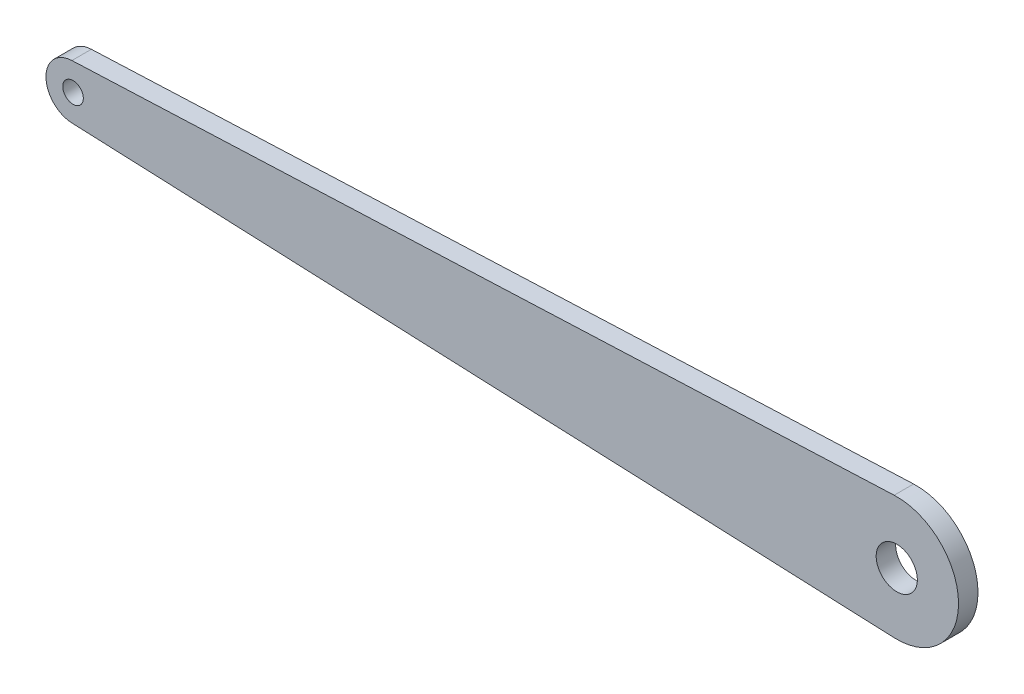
ISO-10303-21;
HEADER;
FILE_DESCRIPTION(('STEP AP214'),'2;1');
FILE_NAME('part.step','',(''),(''),'','','');
FILE_SCHEMA(('AUTOMOTIVE_DESIGN { 1 0 10303 214 1 1 1 1 }'));
ENDSEC;
DATA;
#1=APPLICATION_CONTEXT('core data for automotive mechanical design processes');
#2=APPLICATION_PROTOCOL_DEFINITION('international standard','automotive_design',2000,#1);
#3=PRODUCT_CONTEXT('',#1,'mechanical');
#4=PRODUCT('Part','Part','',(#3));
#5=PRODUCT_RELATED_PRODUCT_CATEGORY('part','',(#4));
#6=PRODUCT_DEFINITION_FORMATION('','',#4);
#7=PRODUCT_DEFINITION_CONTEXT('part definition',#1,'design');
#8=PRODUCT_DEFINITION('design','',#6,#7);
#9=PRODUCT_DEFINITION_SHAPE('','',#8);
#10=(LENGTH_UNIT() NAMED_UNIT(*) SI_UNIT(.MILLI.,.METRE.));
#11=(NAMED_UNIT(*) PLANE_ANGLE_UNIT() SI_UNIT($,.RADIAN.));
#12=(NAMED_UNIT(*) SI_UNIT($,.STERADIAN.) SOLID_ANGLE_UNIT());
#13=UNCERTAINTY_MEASURE_WITH_UNIT(LENGTH_MEASURE(1.E-05),#10,'distance_accuracy_value','');
#14=(GEOMETRIC_REPRESENTATION_CONTEXT(3) GLOBAL_UNCERTAINTY_ASSIGNED_CONTEXT((#13)) GLOBAL_UNIT_ASSIGNED_CONTEXT((#10,
#11,#12)) REPRESENTATION_CONTEXT('',''));
#15=CARTESIAN_POINT('',(0.,0.,0.));
#16=DIRECTION('',(0.,0.,1.));
#17=DIRECTION('',(1.,0.,0.));
#18=AXIS2_PLACEMENT_3D('',#15,#16,#17);
#19=CARTESIAN_POINT('',(127.,0.,3.));
#20=DIRECTION('',(0.,0.,-1.));
#21=DIRECTION('',(-1.,0.,0.));
#22=AXIS2_PLACEMENT_3D('',#19,#20,#21);
#23=PLANE('',#22);
#24=CARTESIAN_POINT('',(127.,0.,3.));
#25=DIRECTION('',(0.,0.,1.));
#26=DIRECTION('',(-1.,0.,0.));
#27=AXIS2_PLACEMENT_3D('',#24,#25,#26);
#28=CIRCLE('',#27,9.525);
#29=CARTESIAN_POINT('',(126.59875,-9.51654472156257,3.));
#30=VERTEX_POINT('',#29);
#31=CARTESIAN_POINT('',(126.59875,9.51654472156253,3.));
#32=VERTEX_POINT('',#31);
#33=EDGE_CURVE('E91',#30,#32,#28,.T.);
#34=ORIENTED_EDGE('',*,*,#33,.T.);
#35=DIRECTION('',(-0.999112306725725,-0.0421259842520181,0.));
#36=VECTOR('',#35,1.);
#37=CARTESIAN_POINT('',(-0.175875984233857,4.17129388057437,3.));
#38=LINE('',#37,#36);
#39=CARTESIAN_POINT('',(-0.175875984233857,4.17129388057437,3.));
#40=VERTEX_POINT('',#39);
#41=EDGE_CURVE('E86',#32,#40,#38,.T.);
#42=ORIENTED_EDGE('',*,*,#41,.T.);
#43=CARTESIAN_POINT('',(0.,0.,3.));
#44=DIRECTION('',(0.,0.,1.));
#45=DIRECTION('',(1.,0.,0.));
#46=AXIS2_PLACEMENT_3D('',#43,#44,#45);
#47=CIRCLE('',#46,4.17499999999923);
#48=CARTESIAN_POINT('',(-0.175875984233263,-4.17129388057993,3.));
#49=VERTEX_POINT('',#48);
#50=EDGE_CURVE('E89',#40,#49,#47,.T.);
#51=ORIENTED_EDGE('',*,*,#50,.T.);
#52=DIRECTION('',(0.999112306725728,-0.0421259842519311,0.));
#53=VECTOR('',#52,1.);
#54=CARTESIAN_POINT('',(-0.175875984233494,-4.17129388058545,3.));
#55=LINE('',#54,#53);
#56=EDGE_CURVE('E56',#49,#30,#55,.T.);
#57=ORIENTED_EDGE('',*,*,#56,.T.);
#58=EDGE_LOOP('',(#34,#42,#51,#57));
#59=FACE_BOUND('',#58,.T.);
#60=CARTESIAN_POINT('',(0.,0.,3.));
#61=DIRECTION('',(0.,0.,1.));
#62=DIRECTION('',(1.,0.,0.));
#63=AXIS2_PLACEMENT_3D('',#60,#61,#62);
#64=CIRCLE('',#63,1.5875);
#65=CARTESIAN_POINT('',(1.5875,0.,3.));
#66=VERTEX_POINT('',#65);
#67=EDGE_CURVE('E106',#66,#66,#64,.T.);
#68=ORIENTED_EDGE('',*,*,#67,.F.);
#69=EDGE_LOOP('',(#68));
#70=FACE_BOUND('',#69,.T.);
#71=CARTESIAN_POINT('',(127.,0.,3.));
#72=DIRECTION('',(0.,0.,1.));
#73=DIRECTION('',(1.,0.,0.));
#74=AXIS2_PLACEMENT_3D('',#71,#72,#73);
#75=CIRCLE('',#74,3.175);
#76=CARTESIAN_POINT('',(130.175,0.,3.));
#77=VERTEX_POINT('',#76);
#78=EDGE_CURVE('E121',#77,#77,#75,.T.);
#79=ORIENTED_EDGE('',*,*,#78,.F.);
#80=EDGE_LOOP('',(#79));
#81=FACE_BOUND('',#80,.T.);
#82=ADVANCED_FACE('F39',(#59,#70,#81),#23,.F.);
#83=CARTESIAN_POINT('',(127.,0.,0.));
#84=DIRECTION('',(0.,0.,-1.));
#85=DIRECTION('',(-1.,0.,0.));
#86=AXIS2_PLACEMENT_3D('',#83,#84,#85);
#87=PLANE('',#86);
#88=CARTESIAN_POINT('',(0.,0.,0.));
#89=DIRECTION('',(0.,0.,1.));
#90=DIRECTION('',(1.,0.,0.));
#91=AXIS2_PLACEMENT_3D('',#88,#89,#90);
#92=CIRCLE('',#91,1.5875);
#93=CARTESIAN_POINT('',(1.5875,0.,0.));
#94=VERTEX_POINT('',#93);
#95=EDGE_CURVE('E118',#94,#94,#92,.T.);
#96=ORIENTED_EDGE('',*,*,#95,.T.);
#97=EDGE_LOOP('',(#96));
#98=FACE_BOUND('',#97,.T.);
#99=CARTESIAN_POINT('',(127.,0.,0.));
#100=DIRECTION('',(0.,0.,1.));
#101=DIRECTION('',(-1.,0.,0.));
#102=AXIS2_PLACEMENT_3D('',#99,#100,#101);
#103=CIRCLE('',#102,9.525);
#104=CARTESIAN_POINT('',(126.59875,-9.51654472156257,0.));
#105=VERTEX_POINT('',#104);
#106=CARTESIAN_POINT('',(126.59875,9.51654472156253,0.));
#107=VERTEX_POINT('',#106);
#108=EDGE_CURVE('E103',#105,#107,#103,.T.);
#109=ORIENTED_EDGE('',*,*,#108,.F.);
#110=DIRECTION('',(0.999112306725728,-0.0421259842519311,0.));
#111=VECTOR('',#110,1.);
#112=CARTESIAN_POINT('',(-0.175875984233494,-4.17129388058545,0.));
#113=LINE('',#112,#111);
#114=CARTESIAN_POINT('',(-0.175875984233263,-4.17129388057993,0.));
#115=VERTEX_POINT('',#114);
#116=EDGE_CURVE('E79',#115,#105,#113,.T.);
#117=ORIENTED_EDGE('',*,*,#116,.F.);
#118=CARTESIAN_POINT('',(0.,0.,0.));
#119=DIRECTION('',(0.,0.,1.));
#120=DIRECTION('',(1.,0.,0.));
#121=AXIS2_PLACEMENT_3D('',#118,#119,#120);
#122=CIRCLE('',#121,4.17499999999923);
#123=CARTESIAN_POINT('',(-0.175875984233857,4.17129388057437,0.));
#124=VERTEX_POINT('',#123);
#125=EDGE_CURVE('E73',#124,#115,#122,.T.);
#126=ORIENTED_EDGE('',*,*,#125,.F.);
#127=DIRECTION('',(-0.999112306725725,-0.0421259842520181,0.));
#128=VECTOR('',#127,1.);
#129=CARTESIAN_POINT('',(-0.175875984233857,4.17129388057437,0.));
#130=LINE('',#129,#128);
#131=EDGE_CURVE('E95',#107,#124,#130,.T.);
#132=ORIENTED_EDGE('',*,*,#131,.F.);
#133=EDGE_LOOP('',(#109,#117,#126,#132));
#134=FACE_BOUND('',#133,.T.);
#135=CARTESIAN_POINT('',(127.,0.,0.));
#136=DIRECTION('',(0.,0.,1.));
#137=DIRECTION('',(1.,0.,0.));
#138=AXIS2_PLACEMENT_3D('',#135,#136,#137);
#139=CIRCLE('',#138,3.175);
#140=CARTESIAN_POINT('',(130.175,0.,0.));
#141=VERTEX_POINT('',#140);
#142=EDGE_CURVE('E124',#141,#141,#139,.T.);
#143=ORIENTED_EDGE('',*,*,#142,.T.);
#144=EDGE_LOOP('',(#143));
#145=FACE_BOUND('',#144,.T.);
#146=ADVANCED_FACE('F114',(#98,#134,#145),#87,.T.);
#147=CARTESIAN_POINT('',(127.,0.,3.));
#148=DIRECTION('',(0.,0.,-1.));
#149=DIRECTION('',(-1.,0.,0.));
#150=AXIS2_PLACEMENT_3D('',#147,#148,#149);
#151=CYLINDRICAL_SURFACE('',#150,9.525);
#152=ORIENTED_EDGE('',*,*,#108,.T.);
#153=DIRECTION('',(0.,0.,-1.));
#154=VECTOR('',#153,1.);
#155=CARTESIAN_POINT('',(126.59875,9.51654472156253,3.));
#156=LINE('',#155,#154);
#157=EDGE_CURVE('E11',#32,#107,#156,.T.);
#158=ORIENTED_EDGE('',*,*,#157,.F.);
#159=ORIENTED_EDGE('',*,*,#33,.F.);
#160=DIRECTION('',(0.,0.,-1.));
#161=VECTOR('',#160,1.);
#162=CARTESIAN_POINT('',(126.59875,-9.51654472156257,3.));
#163=LINE('',#162,#161);
#164=EDGE_CURVE('E99',#30,#105,#163,.T.);
#165=ORIENTED_EDGE('',*,*,#164,.T.);
#166=EDGE_LOOP('',(#152,#158,#159,#165));
#167=FACE_BOUND('',#166,.T.);
#168=ADVANCED_FACE('F41',(#167),#151,.T.);
#169=CARTESIAN_POINT('',(-0.175875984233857,4.17129388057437,3.));
#170=DIRECTION('',(0.0421259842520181,-0.999112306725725,0.));
#171=DIRECTION('',(0.999112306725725,0.0421259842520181,0.));
#172=AXIS2_PLACEMENT_3D('',#169,#170,#171);
#173=PLANE('',#172);
#174=ORIENTED_EDGE('',*,*,#131,.T.);
#175=DIRECTION('',(0.,0.,-1.));
#176=VECTOR('',#175,1.);
#177=CARTESIAN_POINT('',(-0.175875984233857,4.17129388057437,3.));
#178=LINE('',#177,#176);
#179=EDGE_CURVE('E48',#40,#124,#178,.T.);
#180=ORIENTED_EDGE('',*,*,#179,.F.);
#181=ORIENTED_EDGE('',*,*,#41,.F.);
#182=ORIENTED_EDGE('',*,*,#157,.T.);
#183=EDGE_LOOP('',(#174,#180,#181,#182));
#184=FACE_BOUND('',#183,.T.);
#185=ADVANCED_FACE('F94',(#184),#173,.F.);
#186=CARTESIAN_POINT('',(0.,0.,3.));
#187=DIRECTION('',(0.,0.,-1.));
#188=DIRECTION('',(-1.,0.,0.));
#189=AXIS2_PLACEMENT_3D('',#186,#187,#188);
#190=CYLINDRICAL_SURFACE('',#189,4.17499999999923);
#191=ORIENTED_EDGE('',*,*,#125,.T.);
#192=DIRECTION('',(0.,0.,-1.));
#193=VECTOR('',#192,1.);
#194=CARTESIAN_POINT('',(-0.175875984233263,-4.17129388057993,3.));
#195=LINE('',#194,#193);
#196=EDGE_CURVE('E96',#49,#115,#195,.T.);
#197=ORIENTED_EDGE('',*,*,#196,.F.);
#198=ORIENTED_EDGE('',*,*,#50,.F.);
#199=ORIENTED_EDGE('',*,*,#179,.T.);
#200=EDGE_LOOP('',(#191,#197,#198,#199));
#201=FACE_BOUND('',#200,.T.);
#202=ADVANCED_FACE('F97',(#201),#190,.T.);
#203=CARTESIAN_POINT('',(-0.175875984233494,-4.17129388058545,3.));
#204=DIRECTION('',(0.0421259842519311,0.999112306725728,0.));
#205=DIRECTION('',(-0.999112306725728,0.0421259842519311,0.));
#206=AXIS2_PLACEMENT_3D('',#203,#204,#205);
#207=PLANE('',#206);
#208=ORIENTED_EDGE('',*,*,#116,.T.);
#209=ORIENTED_EDGE('',*,*,#164,.F.);
#210=ORIENTED_EDGE('',*,*,#56,.F.);
#211=ORIENTED_EDGE('',*,*,#196,.T.);
#212=EDGE_LOOP('',(#208,#209,#210,#211));
#213=FACE_BOUND('',#212,.T.);
#214=ADVANCED_FACE('F111',(#213),#207,.F.);
#215=CARTESIAN_POINT('',(0.,0.,3.));
#216=DIRECTION('',(0.,0.,-1.));
#217=DIRECTION('',(-1.,0.,0.));
#218=AXIS2_PLACEMENT_3D('',#215,#216,#217);
#219=CYLINDRICAL_SURFACE('',#218,1.5875);
#220=ORIENTED_EDGE('',*,*,#67,.T.);
#221=EDGE_LOOP('',(#220));
#222=FACE_BOUND('',#221,.T.);
#223=ORIENTED_EDGE('',*,*,#95,.F.);
#224=EDGE_LOOP('',(#223));
#225=FACE_BOUND('',#224,.T.);
#226=ADVANCED_FACE('F141',(#222,#225),#219,.F.);
#227=CARTESIAN_POINT('',(127.,0.,3.));
#228=DIRECTION('',(0.,0.,-1.));
#229=DIRECTION('',(-1.,0.,0.));
#230=AXIS2_PLACEMENT_3D('',#227,#228,#229);
#231=CYLINDRICAL_SURFACE('',#230,3.175);
#232=ORIENTED_EDGE('',*,*,#78,.T.);
#233=EDGE_LOOP('',(#232));
#234=FACE_BOUND('',#233,.T.);
#235=ORIENTED_EDGE('',*,*,#142,.F.);
#236=EDGE_LOOP('',(#235));
#237=FACE_BOUND('',#236,.T.);
#238=ADVANCED_FACE('F130',(#234,#237),#231,.F.);
#239=CLOSED_SHELL('',(#82,#146,#168,#185,#202,#214,#226,#238));
#240=MANIFOLD_SOLID_BREP('B2',#239);
#241=ADVANCED_BREP_SHAPE_REPRESENTATION('',(#18,#240),#14);
#242=SHAPE_DEFINITION_REPRESENTATION(#9,#241);
ENDSEC;
END-ISO-10303-21;
